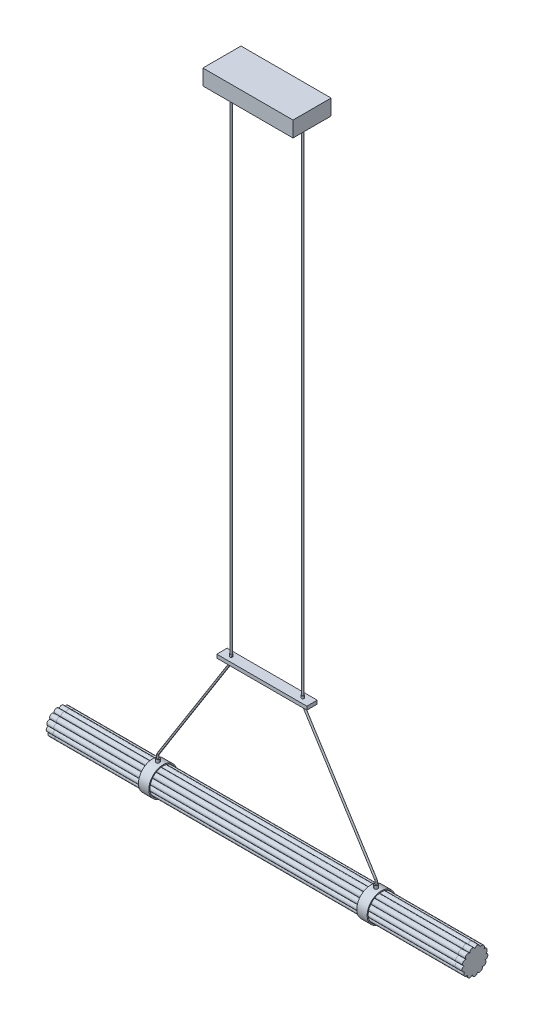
from build123d import *

# Parameters (mm, degrees)
SALIENTE_EXTRUIR1_DEPTH        = 580
SALIENTE_EXTRUIR1_DEPTH_BACK   = 580
SALIENTE_EXTRUIR2_DEPTH        = 580
SALIENTE_EXTRUIR2_DEPTH_BACK   = 580
CROQUIS3_R                     = 7.5
SALIENTE_EXTRUIR3_DEPTH        = 20
CROQUIS5_R                     = 41
CROQUIS5_R_2                   = 38
SALIENTE_EXTRUIR4_DEPTH        = 30
CROQUIS6_W                     = 260
CROQUIS6_H                     = 30
CROQUIS6_R                     = 3.5
SALIENTE_EXTRUIR5_DEPTH        = 10
CROQUIS7_R                     = 5
SALIENTE_EXTRUIR6_DEPTH        = 10
SALIENTE_EXTRUIR7_DEPTH        = 7
SALIENTE_EXTRUIR7_DEPTH_BACK   = 10
CROQUIS8_R                     = 3.5
CROQUIS8_R_2                   = 2.5
SALIENTE_EXTRUIR7_2_DEPTH      = 7
SALIENTE_EXTRUIR7_2_DEPTH_BACK = 10
CORTAR_EXTRUIR5_DEPTH          = 105
CORTAR_EXTRUIR5_DEPTH_BACK     = 105
CROQUIS10_R                    = 1.5
CROQUIS11_R                    = 1.5
SALIENTE_EXTRUIR8_DEPTH        = 2
CHAFL_N1_SIZE                  = 1
VACIADO1_T                     = -1
BARRER3_PROFILE_R              = 2.5
CROQUIS13_W                    = 260.096
CROQUIS13_H                    = 109.982
SALIENTE_EXTRUIR9_DEPTH        = 44.958


with BuildPart() as part:
    # Croquis2 → Saliente-Extruir1 (new, two sides: drawn at the far end of the back side and taken through both)
    with BuildSketch(Plane(origin=(0, 0, 0), x_dir=(0, 0, -1), z_dir=(1, 0, 0)).offset(-SALIENTE_EXTRUIR1_DEPTH_BACK)):
        with BuildLine():
            ThreePointArc((7.489959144, -30.387958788), (0, -22.5), (-7.489959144, -30.387958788))
            ThreePointArc((-7.489959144, -30.387958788), (-17.427118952, -33.204600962), (-20.754018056, -23.426443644))
            ThreePointArc((-20.754018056, -23.426443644), (-30.861894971, -21.302428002), (-29.263581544, -11.098212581))
            ThreePointArc((-29.263581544, -11.098212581), (-37.226582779, -4.52012551), (-31.069211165, 3.772485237))
            ThreePointArc((-31.069211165, 3.772485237), (-35.063109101, 13.297683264), (-25.757258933, 17.77895215))
            ThreePointArc((-25.757258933, 17.77895215), (-24.867099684, 28.069153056), (-14.544629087, 27.712475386))
            ThreePointArc((-14.544629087, 27.712475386), (-8.974337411, 36.410318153), (0, 31.297404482))
            ThreePointArc((0, 31.297404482), (8.974337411, 36.410318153), (14.544629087, 27.712475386))
            ThreePointArc((14.544629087, 27.712475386), (24.867099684, 28.069153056), (25.757258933, 17.77895215))
            ThreePointArc((25.757258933, 17.77895215), (35.063109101, 13.297683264), (31.069211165, 3.772485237))
            ThreePointArc((31.069211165, 3.772485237), (37.226582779, -4.52012551), (29.263581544, -11.098212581))
            ThreePointArc((29.263581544, -11.098212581), (30.861894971, -21.302428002), (20.754018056, -23.426443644))
            ThreePointArc((20.754018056, -23.426443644), (17.427118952, -33.204600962), (7.489959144, -30.387958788))
        make_face()
    extrude(amount=SALIENTE_EXTRUIR1_DEPTH + SALIENTE_EXTRUIR1_DEPTH_BACK)


with BuildPart() as body_2:
    # Croquis3 → Saliente-Extruir2 (new, two sides: drawn at the far end of the back side and taken through both)
    with BuildSketch(Plane(origin=(0, 0, 0), x_dir=(0, 0, -1), z_dir=(1, 0, 0)).offset(-SALIENTE_EXTRUIR2_DEPTH_BACK)):
        with Locations((0, -30)):
            Circle(CROQUIS3_R)
    extrude(amount=SALIENTE_EXTRUIR2_DEPTH + SALIENTE_EXTRUIR2_DEPTH_BACK)


with BuildPart() as body_3:
    # Croquis4 → Saliente-Extruir3 (new body)
    with BuildSketch(Plane.ZY.offset(580)):
        with BuildLine():
            ThreePointArc((-7.489959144, -30.387958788), (0, -37.5), (7.489959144, -30.387958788))
            ThreePointArc((7.489959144, -30.387958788), (17.427118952, -33.204600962), (20.754018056, -23.426443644))
            ThreePointArc((20.754018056, -23.426443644), (30.861894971, -21.302428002), (29.263581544, -11.098212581))
            ThreePointArc((29.263581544, -11.098212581), (37.226582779, -4.52012551), (31.069211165, 3.772485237))
            ThreePointArc((31.069211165, 3.772485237), (35.063109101, 13.297683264), (25.757258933, 17.77895215))
            ThreePointArc((25.757258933, 17.77895215), (24.867099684, 28.069153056), (14.544629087, 27.712475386))
            ThreePointArc((14.544629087, 27.712475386), (8.974337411, 36.410318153), (0, 31.297404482))
            ThreePointArc((0, 31.297404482), (-8.974337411, 36.410318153), (-14.544629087, 27.712475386))
            ThreePointArc((-14.544629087, 27.712475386), (-24.867099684, 28.069153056), (-25.757258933, 17.77895215))
            ThreePointArc((-25.757258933, 17.77895215), (-35.063109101, 13.297683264), (-31.069211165, 3.772485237))
            ThreePointArc((-31.069211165, 3.772485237), (-37.226582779, -4.52012551), (-29.263581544, -11.098212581))
            ThreePointArc((-29.263581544, -11.098212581), (-30.861894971, -21.302428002), (-20.754018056, -23.426443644))
            ThreePointArc((-20.754018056, -23.426443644), (-17.427118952, -33.204600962), (-7.489959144, -30.387958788))
        make_face()
    extrude(amount=SALIENTE_EXTRUIR3_DEPTH)


with BuildPart() as body_4:
    # Simetr_a2: mirrored copy
    add(body_3.part.mirror(Plane(origin=(0, 0, 0), x_dir=(0, 0, 1), z_dir=(1, 0, 0))))


with BuildPart() as body_5:
    # Croquis5 → Saliente-Extruir4 (new body)
    with BuildSketch(Plane(origin=(300, 0, 0), x_dir=(0, 0, -1), z_dir=(1, 0, 0))):
        Circle(CROQUIS5_R)
        Circle(CROQUIS5_R_2, mode=Mode.SUBTRACT)
    extrude(amount=SALIENTE_EXTRUIR4_DEPTH)


with BuildPart() as body_6:
    # Simetr_a3: mirrored copy
    add(body_5.part.mirror(Plane(origin=(0, 0, 0), x_dir=(0, 0, 1), z_dir=(1, 0, 0))))


with BuildPart() as body_7:
    # Croquis6 → Saliente-Extruir5 (new body)
    with BuildSketch(Plane(origin=(0, 400, 0), x_dir=(1, 0, 0), z_dir=(0, 1, 0))):
        Rectangle(CROQUIS6_W, CROQUIS6_H)
        with Locations(Location((103.5, 0, 0), (0, 0, 270))):
            Circle(CROQUIS6_R, mode=Mode.SUBTRACT)
        with Locations(Location((-103.5, 0, 0), (0, 0, 270))):
            Circle(CROQUIS6_R, mode=Mode.SUBTRACT)
    extrude(amount=SALIENTE_EXTRUIR5_DEPTH)


with BuildPart() as body_5_1:
    add(body_5.part)

    add(body_6.part)  # Saliente-Extruir6 merges body 6
    # Croquis7 → Saliente-Extruir6 (add)
    with BuildSketch(Plane(origin=(0, 40, 0), x_dir=(1, 0, 0), z_dir=(0, 1, 0))):
        with Locations(Location((315, 0, 0), (0, 0, 90))):
            Circle(CROQUIS7_R)
        with Locations(Location((-315, 0, 0), (0, 0, 90))):
            Circle(CROQUIS7_R)
    extrude(amount=SALIENTE_EXTRUIR6_DEPTH)


with BuildPart() as body_7_2:
    # Croquis8 → Saliente-Extruir7 (new, two sides: drawn at the far end of the back side and taken through both)
    with BuildSketch(Plane(origin=(0, 410, 0), x_dir=(1, 0, 0), z_dir=(0, 1, 0)).offset(-SALIENTE_EXTRUIR7_DEPTH_BACK)):
        with Locations(Location((103.5, 0, 0), (0, 0, 270))):
            Circle(CROQUIS8_R)
        with Locations(Location((103.5, 0, 0), (0, 0, 270))):
            Circle(CROQUIS8_R_2, mode=Mode.SUBTRACT)
    extrude(amount=SALIENTE_EXTRUIR7_DEPTH + SALIENTE_EXTRUIR7_DEPTH_BACK)


with BuildPart() as body_8:
    # Croquis8 → Saliente-Extruir7 2 (new, two sides: drawn at the far end of the back side and taken through both)
    with BuildSketch(Plane(origin=(0, 410, 0), x_dir=(1, 0, 0), z_dir=(0, 1, 0)).offset(-SALIENTE_EXTRUIR7_2_DEPTH_BACK)):
        with Locations(Location((-103.5, 0, 0), (0, 0, 270))):
            Circle(CROQUIS8_R)
        with Locations(Location((-103.5, 0, 0), (0, 0, 270))):
            Circle(CROQUIS8_R_2, mode=Mode.SUBTRACT)
    extrude(amount=SALIENTE_EXTRUIR7_2_DEPTH + SALIENTE_EXTRUIR7_2_DEPTH_BACK)


with BuildPart() as cortar_extruir5_tool:
    # Croquis10 → Cortar-Extruir5 (new, two sides: drawn at the far end of the back side and taken through both)
    with BuildSketch(Plane(origin=(0, 0, 0), x_dir=(0, 0, -1), z_dir=(1, 0, 0)).offset(-CORTAR_EXTRUIR5_DEPTH_BACK)):
        with Locations(Location((0, 412.5, 0), (0, 0, 180))):
            Circle(CROQUIS10_R)
    extrude(amount=CORTAR_EXTRUIR5_DEPTH + CORTAR_EXTRUIR5_DEPTH_BACK)


with BuildPart() as body_7_2_1:
    add(body_7_2.part)

    # Cortar-Extruir5: cut by cortar_extruir5_tool
    add(cortar_extruir5_tool.part, mode=Mode.SUBTRACT)


with BuildPart() as body_8_1:
    add(body_8.part)

    # Cortar-Extruir5: cut by cortar_extruir5_tool
    add(cortar_extruir5_tool.part, mode=Mode.SUBTRACT)


with BuildPart() as body_9:
    # Croquis11 → Saliente-Extruir8 (new body)
    with BuildSketch(Plane(origin=(100, 0, 0), x_dir=(0, 0, -1), z_dir=(1, 0, 0))):
        with Locations((0, 412.5)):
            Circle(CROQUIS11_R)
    extrude(amount=SALIENTE_EXTRUIR8_DEPTH)

    # Chafl_n1
    chafl_n1_edges = [body_9.edges().sort_by_distance(p)[0] for p in [
        (102, 412.5, 1.5),
    ]]
    chamfer(chafl_n1_edges, length=CHAFL_N1_SIZE)

    # Vaciado1
    vaciado1_openings = [body_9.faces().sort_by_distance(p)[0] for p in [
        (100, 412.5, 0),
    ]]
    offset(amount=VACIADO1_T, openings=vaciado1_openings, kind=Kind.INTERSECTION)


with BuildPart() as body_10:
    # Simetr_a5: mirrored copy
    add(body_9.part.mirror(Plane(origin=(0, 0, 0), x_dir=(0, 0, 1), z_dir=(1, 0, 0))))


with BuildPart() as body_11:
    # Barrer3: sweep along a path in Croquis12
    with BuildLine(Plane.XY) as barrer3_path:
        Line((-315, 50), (-315, 57.107408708))
        ThreePointArc((-315, 57.107408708), (-314.606192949, 59.886087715), (-313.455788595, 62.445914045))
        Line((-313.455788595, 62.445914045), (-105.044211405, 392.554085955))
        ThreePointArc((-105.044211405, 392.554085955), (-103.893807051, 395.113912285), (-103.5, 397.892591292))
        Line((-103.5, 397.892591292), (-103.5, 400))
        Line((-103.5, 400), (-103.5, 1850))
    # Barrer3 profile (on start of the path) → Barrer3 (sweep)
    with BuildSketch(Plane(origin=(-315, 50, 0), x_dir=(1, 0, 0), z_dir=(0, 1, 0))):
        Circle(BARRER3_PROFILE_R)
    sweep(path=barrer3_path.line)


with BuildPart() as body_12:
    # Simetr_a8: mirrored copy
    add(body_11.part.mirror(Plane(origin=(0, 0, 0), x_dir=(0, 0, 1), z_dir=(1, 0, 0))))


with BuildPart() as body_11_1:
    add(body_11.part)

    add(body_12.part)  # Saliente-Extruir9 merges body 12
    # Croquis13 → Saliente-Extruir9 (add)
    with BuildSketch(Plane(origin=(0, 1850, 0), x_dir=(1, 0, 0), z_dir=(0, 1, 0))):
        Rectangle(CROQUIS13_W, CROQUIS13_H)
    extrude(amount=SALIENTE_EXTRUIR9_DEPTH)


solid = Compound([part.part, body_2.part, body_3.part, body_4.part, body_7.part, body_5_1.part, body_7_2_1.part, body_8_1.part, body_9.part, body_10.part, body_11_1.part])
